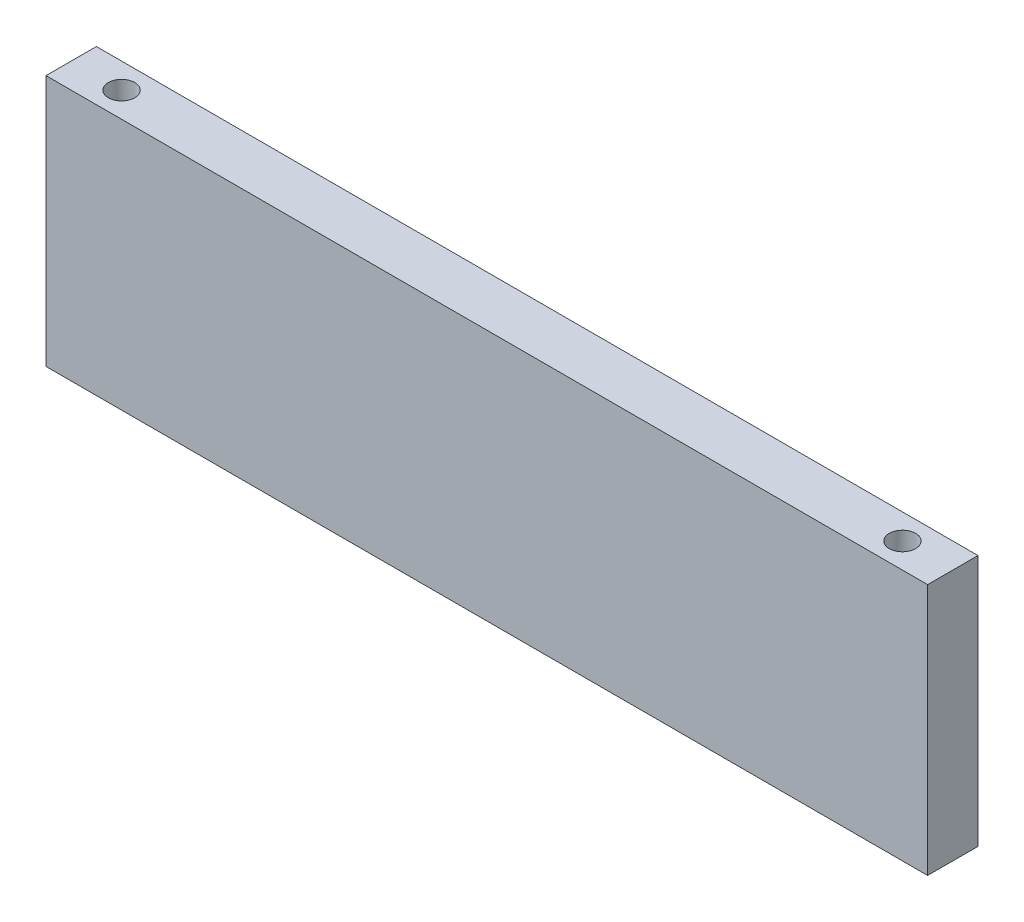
from build123d import *

# Parameters (mm, degrees)
SZKIC1_W                       = 140
SZKIC1_H                       = 40
DODANIE_WYCI_GNI_CIE1_DEPTH    = 8
OTW_R_GWINTOWANY_M5X0_81_D     = 4.2
OTW_R_GWINTOWANY_M5X0_81_DEPTH = 14
OTW_R_GWINTOWANY_M5X0_81_TIP   = 1.2618073
OTW_R_GWINTOWANY_M5X0_82_D     = 4.2
OTW_R_GWINTOWANY_M5X0_82_DEPTH = 14
OTW_R_GWINTOWANY_M5X0_82_TIP   = 1.2618073


with BuildPart() as part:
    # Szkic1 → Dodanie-wyci_gni_cie1 (new body)
    with BuildSketch(Plane.XY):
        with Locations((70, 20)):
            Rectangle(SZKIC1_W, SZKIC1_H)
    extrude(amount=DODANIE_WYCI_GNI_CIE1_DEPTH)

    # Otw_r gwintowany M5x0.81
    with Locations(Plane(origin=(0, 0, 0), x_dir=(-1, 0, 0), z_dir=(0, -1, 0))):
        with Locations((-8, -4), (-132, -4)):
            Hole(OTW_R_GWINTOWANY_M5X0_81_D / 2, depth=OTW_R_GWINTOWANY_M5X0_81_DEPTH)
            with Locations((0, 0, -(OTW_R_GWINTOWANY_M5X0_81_DEPTH + OTW_R_GWINTOWANY_M5X0_81_TIP / 2))):  # 118° drill point
                Cone(0, OTW_R_GWINTOWANY_M5X0_81_D / 2, OTW_R_GWINTOWANY_M5X0_81_TIP, mode=Mode.SUBTRACT)

    # Otw_r gwintowany M5x0.82
    with Locations(Plane(origin=(0, 40, 0), x_dir=(1, 0, 0), z_dir=(0, 1, 0))):
        with Locations((132, -4), (8, -4)):
            Hole(OTW_R_GWINTOWANY_M5X0_82_D / 2, depth=OTW_R_GWINTOWANY_M5X0_82_DEPTH)
            with Locations((0, 0, -(OTW_R_GWINTOWANY_M5X0_82_DEPTH + OTW_R_GWINTOWANY_M5X0_82_TIP / 2))):  # 118° drill point
                Cone(0, OTW_R_GWINTOWANY_M5X0_82_D / 2, OTW_R_GWINTOWANY_M5X0_82_TIP, mode=Mode.SUBTRACT)


solid = part.part
